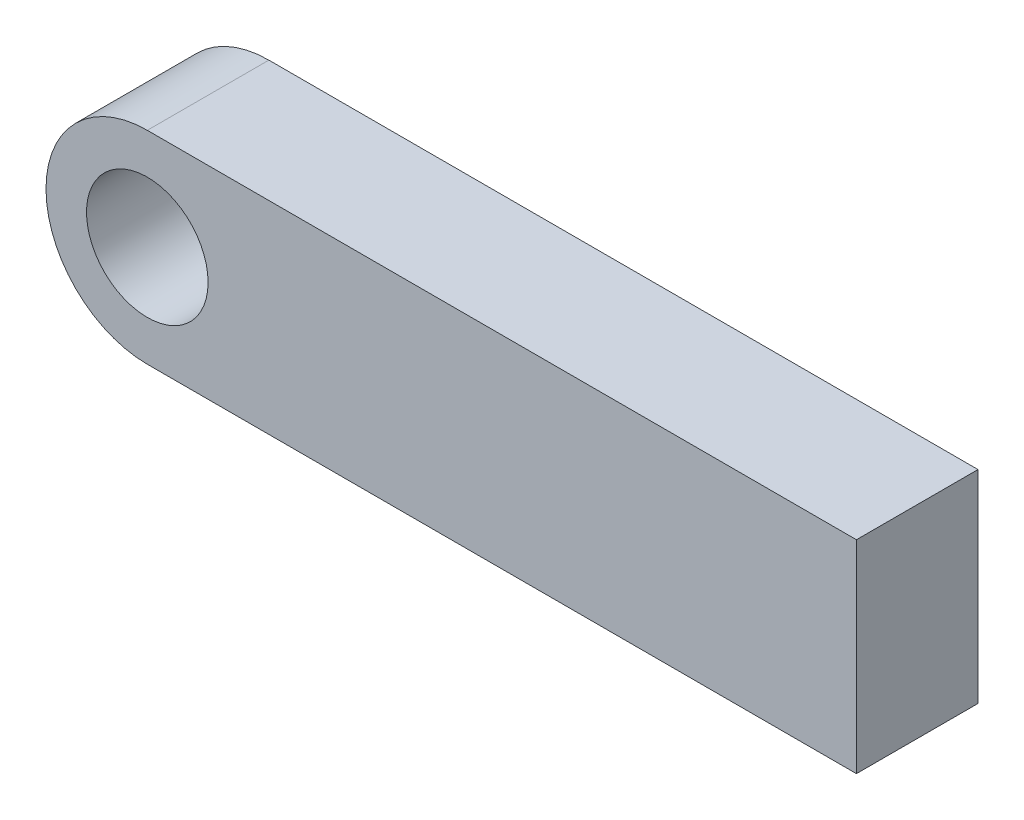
from build123d import *

# Parameters (mm, degrees)
SKETCH1_R      = 3
EXTRUDE1_DEPTH = 3


with BuildPart() as part:
    # Sketch1 → Extrude1 (new, symmetric)
    with BuildSketch(Plane.XY):
        with BuildLine():
            Line((0, -5), (35, -5))
            Line((35, -5), (35, 5))
            Line((35, 5), (0, 5))
            ThreePointArc((0, 5), (-5, 0), (0, -5))
        make_face()
        Circle(SKETCH1_R, mode=Mode.SUBTRACT)
    extrude(amount=EXTRUDE1_DEPTH, both=True)


solid = part.part
